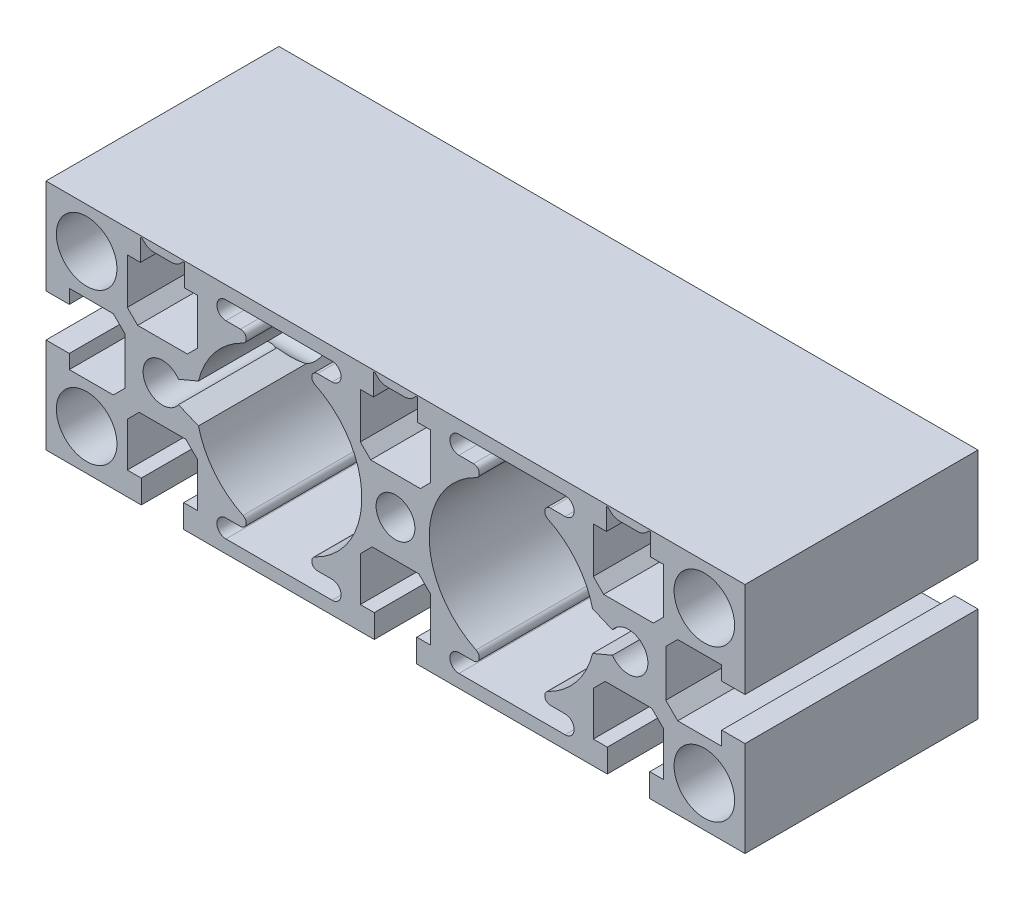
from build123d import *

# Parameters (mm, degrees)
SKETCH1_R      = 5.85
SKETCH1_R_2    = 3.75
EXTRUDE1_DEPTH = 45


with BuildPart() as part:
    # Sketch1 → Extrude1 (new body)
    with BuildSketch(Plane.XY):
        Polygon((62.999999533, 4.100000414), (67.500000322, 4.100000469), (67.500000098, 22.500000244), (-67.499999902, 22.499998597), (-67.499999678, 4.099998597), (-62.999999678, 4.099998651), (-62.999999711, 6.799998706), (-54.500000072, 6.799999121), (-52.200000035, 4.499999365), (-52.199999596, -4.500000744), (-54.499999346, -6.800000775), (-62.999999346, -6.80000119), (-62.999999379, -4.100001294), (-67.499999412, -4.100001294), (-67.499999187, -22.500001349), (-49.099998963, -22.500001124), (-49.099998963, -18.000000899), (-51.799999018, -18.000000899), (-51.799999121, -9.500000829), (-49.499999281, -7.200000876), (-40.499999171, -7.200000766), (-38.199999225, -9.5000006), (-38.199999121, -18.000000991), (-40.899999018, -18.000000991), (-40.899999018, -22.500001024), (-4.099998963, -22.500000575), (-4.099998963, -18.000000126), (-6.799999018, -18.000000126), (-6.799999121, -9.500000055), (-4.499999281, -7.200000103), (4.500000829, -7.199999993), (6.800000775, -9.499999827), (6.800000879, -18.000000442), (4.100000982, -18.000000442), (4.100000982, -22.500000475), (40.900001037, -22.500000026), (40.900001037, -17.999999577), (38.200000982, -17.999999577), (38.200000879, -9.499999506), (40.500000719, -7.199999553), (49.500000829, -7.199999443), (51.800000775, -9.499999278), (51.800000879, -17.999999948), (49.100000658, -17.999999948), (49.100000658, -22.49999998), (67.500000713, -22.499999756), (67.500000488, -4.099999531), (63.000000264, -4.099999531), (63.000000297, -6.799999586), (54.500000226, -6.800000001), (52.200000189, -4.500000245), (52.19999975, 4.499999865), (54.4999995, 6.799999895), (62.9999995, 6.80000031), align=None)
        with Locations(Location((59.65, 14.65, 0), (0, 0, 180))):
            Circle(SKETCH1_R, mode=Mode.SUBTRACT)
        with Locations(Location((59.65, -14.65, 0), (0, 0, 180))):
            Circle(SKETCH1_R, mode=Mode.SUBTRACT)
        with Locations(Location((-59.65, -14.65, 0), (0, 0, 180))):
            Circle(SKETCH1_R, mode=Mode.SUBTRACT)
        with Locations(Location((-59.65, 14.65, 0), (0, 0, 180))):
            Circle(SKETCH1_R, mode=Mode.SUBTRACT)
        with Locations(Location((0, 0, 0), (0, 0, 180))):
            Circle(SKETCH1_R_2, mode=Mode.SUBTRACT)
        with BuildLine():
            Line((-38.054339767, -3.75), (-41.910198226, -2.125))
            ThreePointArc((-41.910198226, -2.125), (-48.75, 0), (-41.910198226, 2.125))
            Line((-41.910198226, 2.125), (-38.054339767, 3.75))
            ThreePointArc((-38.054339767, 3.75), (-34.949722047, 10.050094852), (-29.446108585, 14.413589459))
            ThreePointArc((-29.446108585, 14.413589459), (-28.852553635, 15.646770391), (-29.922620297, 16.499999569))
            Line((-29.922620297, 16.499999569), (-32.749999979, 16.499999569))
            ThreePointArc((-32.749999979, 16.499999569), (-34.499999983, 18.24999953), (-32.750000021, 19.999999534))
            Line((-32.750000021, 19.999999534), (-12.250000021, 19.999999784))
            ThreePointArc((-12.250000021, 19.999999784), (-10.500000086, 18.249999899), (-12.249999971, 16.499999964))
            Line((-12.249999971, 16.499999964), (-15.077380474, 16.499999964))
            ThreePointArc((-15.077380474, 16.499999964), (-16.147447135, 15.646770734), (-15.553892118, 14.413589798))
            ThreePointArc((-15.553892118, 14.413589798), (-6.500000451, 0), (-15.553892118, -14.413589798))
            ThreePointArc((-15.553892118, -14.413589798), (-16.147447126, -15.646770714), (-15.077380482, -16.499999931))
            Line((-15.077380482, -16.499999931), (-12.249999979, -16.499999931))
            ThreePointArc((-12.249999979, -16.499999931), (-10.499999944, -18.250000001), (-12.250000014, -20.000000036))
            Line((-12.250000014, -20.000000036), (-32.750000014, -19.999999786))
            ThreePointArc((-32.750000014, -19.999999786), (-34.500000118, -18.24999964), (-32.749999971, -16.499999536))
            Line((-32.749999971, -16.499999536), (-29.92262029, -16.499999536))
            ThreePointArc((-29.92262029, -16.499999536), (-28.852553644, -15.646770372), (-29.446108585, -14.413589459))
            ThreePointArc((-29.446108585, -14.413589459), (-34.949722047, -10.050094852), (-38.054339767, -3.75))
        make_face(mode=Mode.SUBTRACT)
        with BuildLine():
            Line((12.249999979, -16.5), (15.077380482, -16.5))
            ThreePointArc((15.077380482, -16.5), (16.147447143, -15.64677077), (15.553892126, -14.413589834))
            ThreePointArc((15.553892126, -14.413589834), (6.500000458, -3.6e-08), (15.553892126, 14.413589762))
            ThreePointArc((15.553892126, 14.413589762), (16.147447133, 15.646770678), (15.077380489, 16.499999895))
            Line((15.077380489, 16.499999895), (12.249999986, 16.499999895))
            ThreePointArc((12.249999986, 16.499999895), (10.49999999, 18.249999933), (12.250000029, 19.999999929))
            Line((12.250000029, 19.999999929), (32.750000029, 19.999999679))
            ThreePointArc((32.750000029, 19.999999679), (34.500000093, 18.249999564), (32.749999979, 16.4999995))
            Line((32.749999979, 16.4999995), (29.922620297, 16.4999995))
            ThreePointArc((29.922620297, 16.4999995), (28.852553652, 15.646770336), (29.446108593, 14.413589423))
            ThreePointArc((29.446108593, 14.413589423), (34.949722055, 10.050094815), (38.054339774, 3.749999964))
            Line((38.054339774, 3.749999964), (41.910198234, 2.124999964))
            ThreePointArc((41.910198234, 2.124999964), (48.750000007, -3.6e-08), (41.910198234, -2.125000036))
            Line((41.910198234, -2.125000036), (38.054339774, -3.750000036))
            ThreePointArc((38.054339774, -3.750000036), (34.949722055, -10.050094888), (29.446108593, -14.413589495))
            ThreePointArc((29.446108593, -14.413589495), (28.852553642, -15.646770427), (29.922620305, -16.499999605))
            Line((29.922620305, -16.499999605), (32.749999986, -16.499999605))
            ThreePointArc((32.749999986, -16.499999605), (34.499999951, -18.249999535), (32.750000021, -19.9999995))
            Line((32.750000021, -19.9999995), (12.250000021, -19.99999975))
            ThreePointArc((12.250000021, -19.99999975), (10.500000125, -18.249999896), (12.249999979, -16.5))
        make_face(mode=Mode.SUBTRACT)
        with BuildLine():
            Line((41.05001828, 22.200012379), (41.517795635, 21.732234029))
            ThreePointArc((41.517795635, 21.732234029), (42.328854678, 21.190300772), (43.285564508, 20.999999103))
            Line((43.285564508, 20.999999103), (46.714465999, 20.999999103))
            ThreePointArc((46.714465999, 20.999999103), (47.671213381, 21.190316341), (48.482292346, 21.732291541))
            Line((48.482292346, 21.732291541), (48.949981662, 22.200012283))
            Line((48.949981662, 22.200012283), (49.249999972, 22.200012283))
            Line((49.249999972, 22.200012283), (49.249999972, 17.999999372))
            Line((49.249999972, 17.999999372), (51.800018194, 17.999999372))
            Line((51.800018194, 17.999999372), (51.800018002, 9.200011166))
            Line((51.800018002, 9.200011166), (49.800017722, 7.200011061))
            Line((49.800017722, 7.200011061), (40.200011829, 7.200011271))
            Line((40.200011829, 7.200011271), (38.200011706, 9.200011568))
            Line((38.200011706, 9.200011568), (38.200011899, 17.999999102))
            Line((38.200011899, 17.999999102), (40.749999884, 17.999999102))
            Line((40.749999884, 17.999999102), (40.749999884, 22.200012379))
            Line((40.749999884, 22.200012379), (41.05001828, 22.200012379))
        make_face(mode=Mode.SUBTRACT)
        with BuildLine():
            Line((-3.94998172, 22.200012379), (-3.482204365, 21.732234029))
            ThreePointArc((-3.482204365, 21.732234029), (-2.671145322, 21.190300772), (-1.714435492, 20.999999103))
            Line((-1.714435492, 20.999999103), (1.714465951, 20.999999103))
            ThreePointArc((1.714465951, 20.999999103), (2.671213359, 21.190316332), (3.482292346, 21.732291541))
            Line((3.482292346, 21.732291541), (3.949981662, 22.200012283))
            Line((3.949981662, 22.200012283), (4.249999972, 22.200012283))
            Line((4.249999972, 22.200012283), (4.249999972, 17.999999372))
            Line((4.249999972, 17.999999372), (6.800018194, 17.999999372))
            Line((6.800018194, 17.999999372), (6.800018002, 9.200011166))
            Line((6.800018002, 9.200011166), (4.800017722, 7.200011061))
            Line((4.800017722, 7.200011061), (-4.799988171, 7.200011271))
            Line((-4.799988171, 7.200011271), (-6.799988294, 9.200011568))
            Line((-6.799988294, 9.200011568), (-6.799988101, 17.999999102))
            Line((-6.799988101, 17.999999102), (-4.250000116, 17.999999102))
            Line((-4.250000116, 17.999999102), (-4.250000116, 22.200012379))
            Line((-4.250000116, 22.200012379), (-3.94998172, 22.200012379))
        make_face(mode=Mode.SUBTRACT)
        with BuildLine():
            Line((-49.799988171, 7.200011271), (-51.799988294, 9.200011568))
            Line((-51.799988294, 9.200011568), (-51.799988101, 17.999999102))
            Line((-51.799988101, 17.999999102), (-49.250000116, 17.999999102))
            Line((-49.250000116, 17.999999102), (-49.250000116, 22.200012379))
            Line((-49.250000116, 22.200012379), (-48.94998172, 22.200012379))
            Line((-48.94998172, 22.200012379), (-48.482204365, 21.732234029))
            ThreePointArc((-48.482204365, 21.732234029), (-47.671145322, 21.190300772), (-46.714435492, 20.999999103))
            Line((-46.714435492, 20.999999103), (-43.285534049, 20.999999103))
            ThreePointArc((-43.285534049, 20.999999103), (-42.328786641, 21.190316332), (-41.517707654, 21.732291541))
            Line((-41.517707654, 21.732291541), (-41.050018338, 22.200012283))
            Line((-41.050018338, 22.200012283), (-40.750000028, 22.200012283))
            Line((-40.750000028, 22.200012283), (-40.750000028, 17.999999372))
            Line((-40.750000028, 17.999999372), (-38.199981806, 17.999999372))
            Line((-38.199981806, 17.999999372), (-38.199981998, 9.200011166))
            Line((-38.199981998, 9.200011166), (-40.199982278, 7.200011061))
            Line((-40.199982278, 7.200011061), (-49.799988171, 7.200011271))
        make_face(mode=Mode.SUBTRACT)
    extrude(amount=EXTRUDE1_DEPTH)

    # Sketch3 → 8.2mm DIA HOLE (revolve, cut)
    with BuildSketch(Plane(origin=(67.500000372, 2.44e-07, 22.5), x_dir=(-1.2204125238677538e-08, 1.0, 0), z_dir=(0, 0, 1))):
        Polygon((0, 0), (0, 40.563528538), (4.1, 38.1), (4.1, 0), align=None)
    f_8_2mm_dia_hole = revolve(axis=Axis((73.850000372, 3.22e-07, 22.5), (-1.0, -1.2204125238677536e-08, 0)), mode=Mode.SUBTRACT)

    # Mirror2: 8.2mm DIA HOLE across plane
    add(f_8_2mm_dia_hole.mirror(Plane(origin=(0, 0, 0), x_dir=(0, 0, 1), z_dir=(1, 0, 0))), mode=Mode.SUBTRACT)


solid = part.part
